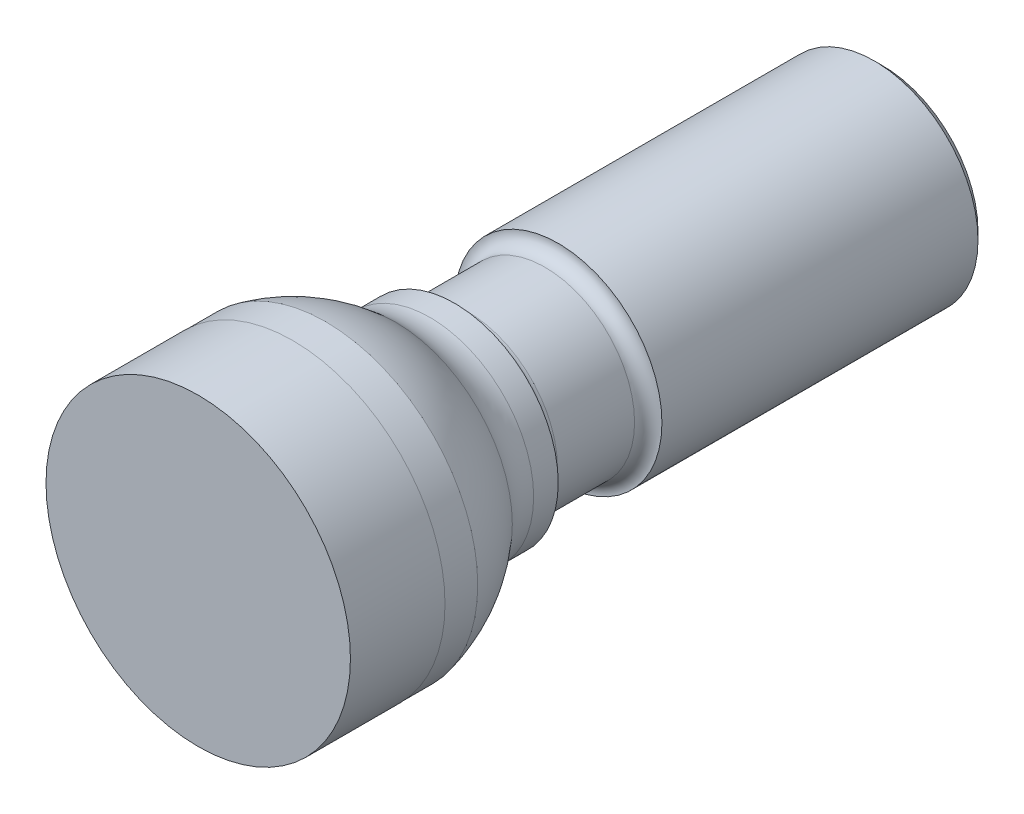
from build123d import *

# Parameters (mm, degrees)
CUT_EXTRUDE1_DEPTH = 6.35


with BuildPart() as part:
    # Sketch1 → Revolve2 (revolve)
    with BuildSketch(Plane(origin=(0, 0, 0), x_dir=(0, 0, -1), z_dir=(1, 0, 0)), mode=Mode.PRIVATE) as revolve2_sk:
        with BuildLine():
            Line((0, 0), (30.604267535, 0))
            Line((30.604267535, 0), (32.512, 3.175))
            Line((32.512, 3.175), (41.91, 3.175))
            Line((41.91, 3.175), (41.91, 5.841978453))
            Line((41.91, 5.841978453), (41.401976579, 6.35))
            Line((41.401976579, 6.35), (22.0472, 6.35))
            ThreePointArc((22.0472, 6.35), (21.828413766, 5.742713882), (21.235989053, 5.4864))
            Line((21.235989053, 5.4864), (16.508410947, 5.4864))
            ThreePointArc((16.508410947, 5.4864), (15.915986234, 5.742713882), (15.6972, 6.35))
            Line((15.6972, 6.35), (14.191460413, 6.35))
            ThreePointArc((14.191460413, 6.35), (13.068928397, 6.555059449), (12.091395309, 7.14375))
            ThreePointArc((12.091395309, 7.14375), (10.088181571, 8.500680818), (7.807702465, 9.3091))
            Line((7.807702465, 9.3091), (5.7912, 9.3091))
            Line((5.7912, 9.3091), (5.7912, 9.3218))
            Line((5.7912, 9.3218), (0, 9.3218))
            Line((0, 9.3218), (0, 0))
        make_face()
    revolve(revolve2_sk.sketch.rotate(Axis((0, 0, 0), (0, 0, -1)), 90), axis=Axis((0, 0, 0), (0, 0, -1)))

    # Sketch2 → Cut-Extrude1 (cut)
    with BuildSketch(Plane(origin=(0, 0, -41.91), x_dir=(-1, 0, 0), z_dir=(0, 0, -1))):
        Polygon((3.666174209, 0), (1.833087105, 3.175), (-1.833087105, 3.175), (-3.666174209, 0), (-1.833087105, -3.175), (1.833087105, -3.175), align=None)
    extrude(amount=-CUT_EXTRUDE1_DEPTH, mode=Mode.SUBTRACT)


solid = part.part
